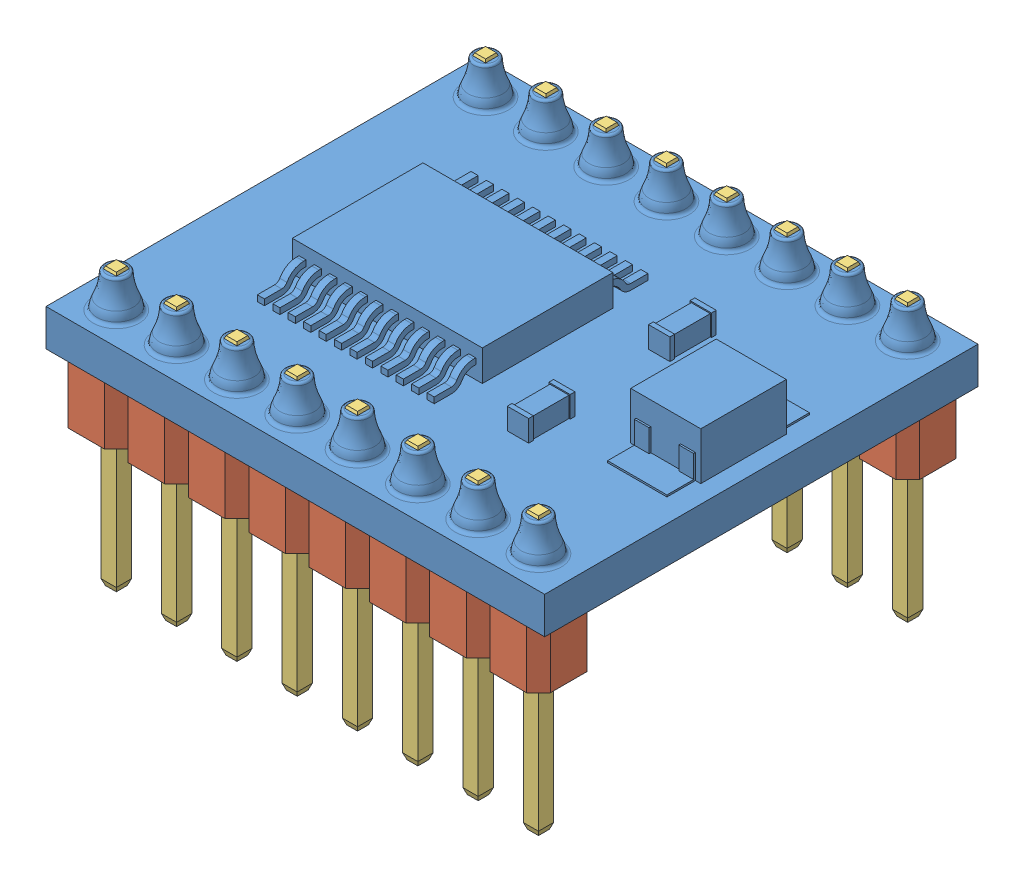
SolidWorks assembly TB6612FNG.SLDASM, configuration По умолчанию (file format 15000). Lengths in mm.
Overall size (21 12.05 18.25).
33 component instances, 3 part files, 7 mates.
Components (placement in the parent):
- Base-1: Base.SLDPRT [По умолчанию] at origin
- Основание пина-1: Основание пина.SLDPRT [По умолчанию] at (8.89 -2.5 7.775)
- Основание пина-2: Основание пина.SLDPRT [По умолчанию] at (6.35 -2.5 7.775)
- Основание пина-3: Основание пина.SLDPRT [По умолчанию] at (3.81 -2.5 7.775)
- Основание пина-4: Основание пина.SLDPRT [По умолчанию] at (1.27 -2.5 7.775)
- Основание пина-5: Основание пина.SLDPRT [По умолчанию] at (-1.27 -2.5 7.775)
- Основание пина-6: Основание пина.SLDPRT [По умолчанию] at (-3.81 -2.5 7.775)
- Основание пина-7: Основание пина.SLDPRT [По умолчанию] at (-6.35 -2.5 7.775)
- Основание пина-8: Основание пина.SLDPRT [По умолчанию] at (-8.89 -2.5 7.775)
- Основание пина-9: Основание пина.SLDPRT [По умолчанию] at (8.89 -2.5 -7.775)
- Основание пина-10: Основание пина.SLDPRT [По умолчанию] at (6.35 -2.5 -7.775)
- Основание пина-11: Основание пина.SLDPRT [По умолчанию] at (3.81 -2.5 -7.775)
- Основание пина-12: Основание пина.SLDPRT [По умолчанию] at (1.27 -2.5 -7.775)
- Основание пина-13: Основание пина.SLDPRT [По умолчанию] at (-1.27 -2.5 -7.775)
- Основание пина-14: Основание пина.SLDPRT [По умолчанию] at (-3.81 -2.5 -7.775)
- Основание пина-15: Основание пина.SLDPRT [По умолчанию] at (-6.35 -2.5 -7.775)
- Основание пина-16: Основание пина.SLDPRT [По умолчанию] at (-8.89 -2.5 -7.775)
- Пин-1: Пин.SLDPRT [По умолчанию] at (-8.89 -8.5 7.775) x (-1 0 0) z (0 0 -1)
- Пин-2: Пин.SLDPRT [По умолчанию] at (-6.35 -8.5 7.775) x (-1 0 0) z (0 0 -1)
- Пин-3: Пин.SLDPRT [По умолчанию] at (-3.81 -8.5 7.775) x (-1 0 0) z (0 0 -1)
- Пин-4: Пин.SLDPRT [По умолчанию] at (-1.27 -8.5 7.775) x (-1 0 0) z (0 0 -1)
- Пин-5: Пин.SLDPRT [По умолчанию] at (1.27 -8.5 7.775) x (-1 0 0) z (0 0 -1)
- Пин-6: Пин.SLDPRT [По умолчанию] at (3.81 -8.5 7.775) x (-1 0 0) z (0 0 -1)
- Пин-7: Пин.SLDPRT [По умолчанию] at (6.35 -8.5 7.775) x (-1 0 0) z (0 0 -1)
- Пин-8: Пин.SLDPRT [По умолчанию] at (8.89 -8.5 7.775) x (-1 0 0) z (0 0 -1)
- Пин-9: Пин.SLDPRT [По умолчанию] at (-8.89 -8.5 -7.775) x (-1 0 0) z (0 0 -1)
- Пин-10: Пин.SLDPRT [По умолчанию] at (-6.35 -8.5 -7.775) x (-1 0 0) z (0 0 -1)
- Пин-11: Пин.SLDPRT [По умолчанию] at (-3.81 -8.5 -7.775) x (-1 0 0) z (0 0 -1)
- Пин-12: Пин.SLDPRT [По умолчанию] at (-1.27 -8.5 -7.775) x (-1 0 0) z (0 0 -1)
- Пин-13: Пин.SLDPRT [По умолчанию] at (1.27 -8.5 -7.775) x (-1 0 0) z (0 0 -1)
- Пин-14: Пин.SLDPRT [По умолчанию] at (3.81 -8.5 -7.775) x (-1 0 0) z (0 0 -1)
- Пин-15: Пин.SLDPRT [По умолчанию] at (6.35 -8.5 -7.775) x (-1 0 0) z (0 0 -1)
- Пин-16: Пин.SLDPRT [По умолчанию] at (8.89 -8.5 -7.775) x (-1 0 0) z (0 0 -1)
Mates (geometry in assembly coordinates):
- Ширина1: width anti-aligned: plane of Основание пина-1 through (10.16 0 6.505) normal (1 0 0); plane of Основание пина-1 through (7.62 0 6.505) normal (-1 0 0); plane of Base-1 through (9.24 0 8.125) normal (-1 0 0); plane of Base-1 through (8.54 0 8.125) normal (1 0 0)
- Ширина2: width anti-aligned: plane of Основание пина-1 through (7.62 0 9.045) normal (0 0 1); plane of Основание пина-1 through (7.62 0 6.505) normal (0 0 -1); plane of Base-1 through (8.54 0 8.125) normal (0 0 -1); plane of Base-1 through (8.54 0 7.425) normal (0 0 1)
- Совпадение1: coincident anti-aligned: plane of Base-1 through (0 0 0) normal (0 -1 0); plane of Основание пина-1 through (8.89 0 7.775) normal (0 1 0)
- Ширина3: width anti-aligned: plane of Base-1 through (-8.54 0 8.125) normal (-1 0 0); plane of Base-1 through (-9.24 0 8.125) normal (1 0 0); plane of Пин-1 through (-9.21 3.16 7.455) normal (-1 0 0); plane of Пин-1 through (-8.57 3.16 7.455) normal (1 0 0)
- Ширина4: width anti-aligned: plane of Пин-1 through (-8.57 3.16 7.455) normal (0 0 -1); plane of Пин-1 through (-8.57 3.16 8.095) normal (0 0 1); plane of Base-1 through (-8.54 0 8.125) normal (0 0 -1); plane of Base-1 through (-8.54 0 7.425) normal (0 0 1)
- Расстояние1: distance = 6 mm aligned: plane of Пин-1 through (-8.89 -8.5 7.775) normal (0 -1 0); plane of Основание пина-8 through (-8.89 -2.5 7.775) normal (0 -1 0)
- Совпадение2: coincident: plane of Base-1 through (0 1.55 0) normal (0 1 0); plane of Основание пина-1 through (8.89 1.55 7.775) normal (0 -1 0)
